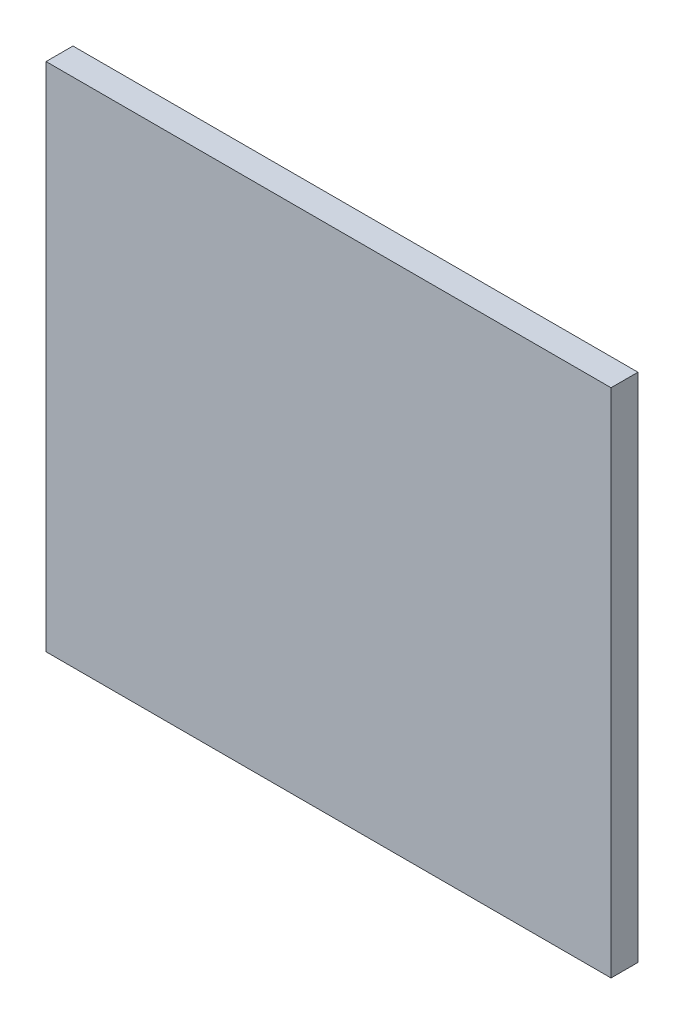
ISO-10303-21;
HEADER;
FILE_DESCRIPTION(('STEP AP214'),'2;1');
FILE_NAME('part.step','',(''),(''),'','','');
FILE_SCHEMA(('AUTOMOTIVE_DESIGN { 1 0 10303 214 1 1 1 1 }'));
ENDSEC;
DATA;
#1=APPLICATION_CONTEXT('core data for automotive mechanical design processes');
#2=APPLICATION_PROTOCOL_DEFINITION('international standard','automotive_design',2000,#1);
#3=PRODUCT_CONTEXT('',#1,'mechanical');
#4=PRODUCT('Part','Part','',(#3));
#5=PRODUCT_RELATED_PRODUCT_CATEGORY('part','',(#4));
#6=PRODUCT_DEFINITION_FORMATION('','',#4);
#7=PRODUCT_DEFINITION_CONTEXT('part definition',#1,'design');
#8=PRODUCT_DEFINITION('design','',#6,#7);
#9=PRODUCT_DEFINITION_SHAPE('','',#8);
#10=(LENGTH_UNIT() NAMED_UNIT(*) SI_UNIT(.MILLI.,.METRE.));
#11=(NAMED_UNIT(*) PLANE_ANGLE_UNIT() SI_UNIT($,.RADIAN.));
#12=(NAMED_UNIT(*) SI_UNIT($,.STERADIAN.) SOLID_ANGLE_UNIT());
#13=UNCERTAINTY_MEASURE_WITH_UNIT(LENGTH_MEASURE(1.E-05),#10,'distance_accuracy_value','');
#14=(GEOMETRIC_REPRESENTATION_CONTEXT(3) GLOBAL_UNCERTAINTY_ASSIGNED_CONTEXT((#13)) GLOBAL_UNIT_ASSIGNED_CONTEXT((#10,
#11,#12)) REPRESENTATION_CONTEXT('',''));
#15=CARTESIAN_POINT('',(0.,0.,0.));
#16=DIRECTION('',(0.,0.,1.));
#17=DIRECTION('',(1.,0.,0.));
#18=AXIS2_PLACEMENT_3D('',#15,#16,#17);
#19=CARTESIAN_POINT('',(-50.,40.,6.));
#20=DIRECTION('',(1.,0.,0.));
#21=DIRECTION('',(0.,1.,0.));
#22=AXIS2_PLACEMENT_3D('',#19,#20,#21);
#23=PLANE('',#22);
#24=DIRECTION('',(0.,-1.,0.));
#25=VECTOR('',#24,1.);
#26=CARTESIAN_POINT('',(-50.,40.,0.));
#27=LINE('',#26,#25);
#28=CARTESIAN_POINT('',(-50.,40.,0.));
#29=VERTEX_POINT('',#28);
#30=CARTESIAN_POINT('',(-50.,-74.,0.));
#31=VERTEX_POINT('',#30);
#32=EDGE_CURVE('E70',#29,#31,#27,.T.);
#33=ORIENTED_EDGE('',*,*,#32,.T.);
#34=DIRECTION('',(0.,0.,-1.));
#35=VECTOR('',#34,1.);
#36=CARTESIAN_POINT('',(-50.,-74.,6.));
#37=LINE('',#36,#35);
#38=CARTESIAN_POINT('',(-50.,-74.,6.));
#39=VERTEX_POINT('',#38);
#40=EDGE_CURVE('E11',#39,#31,#37,.T.);
#41=ORIENTED_EDGE('',*,*,#40,.F.);
#42=DIRECTION('',(0.,-1.,0.));
#43=VECTOR('',#42,1.);
#44=CARTESIAN_POINT('',(-50.,40.,6.));
#45=LINE('',#44,#43);
#46=CARTESIAN_POINT('',(-50.,40.,6.));
#47=VERTEX_POINT('',#46);
#48=EDGE_CURVE('E88',#47,#39,#45,.T.);
#49=ORIENTED_EDGE('',*,*,#48,.F.);
#50=DIRECTION('',(0.,0.,-1.));
#51=VECTOR('',#50,1.);
#52=CARTESIAN_POINT('',(-50.,40.,6.));
#53=LINE('',#52,#51);
#54=EDGE_CURVE('E82',#47,#29,#53,.T.);
#55=ORIENTED_EDGE('',*,*,#54,.T.);
#56=EDGE_LOOP('',(#33,#41,#49,#55));
#57=FACE_BOUND('',#56,.T.);
#58=ADVANCED_FACE('F26',(#57),#23,.F.);
#59=CARTESIAN_POINT('',(-50.,-74.,6.));
#60=DIRECTION('',(0.,1.,0.));
#61=DIRECTION('',(0.,0.,1.));
#62=AXIS2_PLACEMENT_3D('',#59,#60,#61);
#63=PLANE('',#62);
#64=DIRECTION('',(1.,0.,0.));
#65=VECTOR('',#64,1.);
#66=CARTESIAN_POINT('',(-50.,-74.,0.));
#67=LINE('',#66,#65);
#68=CARTESIAN_POINT('',(76.,-74.,0.));
#69=VERTEX_POINT('',#68);
#70=EDGE_CURVE('E66',#31,#69,#67,.T.);
#71=ORIENTED_EDGE('',*,*,#70,.T.);
#72=DIRECTION('',(0.,0.,-1.));
#73=VECTOR('',#72,1.);
#74=CARTESIAN_POINT('',(76.,-74.,6.));
#75=LINE('',#74,#73);
#76=CARTESIAN_POINT('',(76.,-74.,6.));
#77=VERTEX_POINT('',#76);
#78=EDGE_CURVE('E33',#77,#69,#75,.T.);
#79=ORIENTED_EDGE('',*,*,#78,.F.);
#80=DIRECTION('',(1.,0.,0.));
#81=VECTOR('',#80,1.);
#82=CARTESIAN_POINT('',(-50.,-74.,6.));
#83=LINE('',#82,#81);
#84=EDGE_CURVE('E78',#39,#77,#83,.T.);
#85=ORIENTED_EDGE('',*,*,#84,.F.);
#86=ORIENTED_EDGE('',*,*,#40,.T.);
#87=EDGE_LOOP('',(#71,#79,#85,#86));
#88=FACE_BOUND('',#87,.T.);
#89=ADVANCED_FACE('F77',(#88),#63,.F.);
#90=CARTESIAN_POINT('',(76.,40.,6.));
#91=DIRECTION('',(-1.,0.,0.));
#92=DIRECTION('',(0.,-1.,0.));
#93=AXIS2_PLACEMENT_3D('',#90,#91,#92);
#94=PLANE('',#93);
#95=DIRECTION('',(0.,1.,0.));
#96=VECTOR('',#95,1.);
#97=CARTESIAN_POINT('',(76.,40.,0.));
#98=LINE('',#97,#96);
#99=CARTESIAN_POINT('',(76.,40.,0.));
#100=VERTEX_POINT('',#99);
#101=EDGE_CURVE('E71',#69,#100,#98,.T.);
#102=ORIENTED_EDGE('',*,*,#101,.T.);
#103=DIRECTION('',(0.,0.,-1.));
#104=VECTOR('',#103,1.);
#105=CARTESIAN_POINT('',(76.,40.,6.));
#106=LINE('',#105,#104);
#107=CARTESIAN_POINT('',(76.,40.,6.));
#108=VERTEX_POINT('',#107);
#109=EDGE_CURVE('E94',#108,#100,#106,.T.);
#110=ORIENTED_EDGE('',*,*,#109,.F.);
#111=DIRECTION('',(0.,1.,0.));
#112=VECTOR('',#111,1.);
#113=CARTESIAN_POINT('',(76.,40.,6.));
#114=LINE('',#113,#112);
#115=EDGE_CURVE('E45',#77,#108,#114,.T.);
#116=ORIENTED_EDGE('',*,*,#115,.F.);
#117=ORIENTED_EDGE('',*,*,#78,.T.);
#118=EDGE_LOOP('',(#102,#110,#116,#117));
#119=FACE_BOUND('',#118,.T.);
#120=ADVANCED_FACE('F97',(#119),#94,.F.);
#121=CARTESIAN_POINT('',(-50.,40.,6.));
#122=DIRECTION('',(0.,-1.,0.));
#123=DIRECTION('',(0.,0.,-1.));
#124=AXIS2_PLACEMENT_3D('',#121,#122,#123);
#125=PLANE('',#124);
#126=DIRECTION('',(-1.,0.,0.));
#127=VECTOR('',#126,1.);
#128=CARTESIAN_POINT('',(-50.,40.,0.));
#129=LINE('',#128,#127);
#130=EDGE_CURVE('E86',#100,#29,#129,.T.);
#131=ORIENTED_EDGE('',*,*,#130,.T.);
#132=ORIENTED_EDGE('',*,*,#54,.F.);
#133=DIRECTION('',(-1.,0.,0.));
#134=VECTOR('',#133,1.);
#135=CARTESIAN_POINT('',(-50.,40.,6.));
#136=LINE('',#135,#134);
#137=EDGE_CURVE('E40',#108,#47,#136,.T.);
#138=ORIENTED_EDGE('',*,*,#137,.F.);
#139=ORIENTED_EDGE('',*,*,#109,.T.);
#140=EDGE_LOOP('',(#131,#132,#138,#139));
#141=FACE_BOUND('',#140,.T.);
#142=ADVANCED_FACE('F99',(#141),#125,.F.);
#143=CARTESIAN_POINT('',(-50.,-74.,6.));
#144=DIRECTION('',(0.,0.,1.));
#145=DIRECTION('',(1.,0.,0.));
#146=AXIS2_PLACEMENT_3D('',#143,#144,#145);
#147=PLANE('',#146);
#148=ORIENTED_EDGE('',*,*,#48,.T.);
#149=ORIENTED_EDGE('',*,*,#84,.T.);
#150=ORIENTED_EDGE('',*,*,#115,.T.);
#151=ORIENTED_EDGE('',*,*,#137,.T.);
#152=EDGE_LOOP('',(#148,#149,#150,#151));
#153=FACE_BOUND('',#152,.T.);
#154=ADVANCED_FACE('F100',(#153),#147,.T.);
#155=CARTESIAN_POINT('',(-50.,-74.,0.));
#156=DIRECTION('',(0.,0.,1.));
#157=DIRECTION('',(1.,0.,0.));
#158=AXIS2_PLACEMENT_3D('',#155,#156,#157);
#159=PLANE('',#158);
#160=ORIENTED_EDGE('',*,*,#32,.F.);
#161=ORIENTED_EDGE('',*,*,#130,.F.);
#162=ORIENTED_EDGE('',*,*,#101,.F.);
#163=ORIENTED_EDGE('',*,*,#70,.F.);
#164=EDGE_LOOP('',(#160,#161,#162,#163));
#165=FACE_BOUND('',#164,.T.);
#166=ADVANCED_FACE('F67',(#165),#159,.F.);
#167=CLOSED_SHELL('',(#58,#89,#120,#142,#154,#166));
#168=MANIFOLD_SOLID_BREP('B2',#167);
#169=ADVANCED_BREP_SHAPE_REPRESENTATION('',(#18,#168),#14);
#170=SHAPE_DEFINITION_REPRESENTATION(#9,#169);
ENDSEC;
END-ISO-10303-21;
